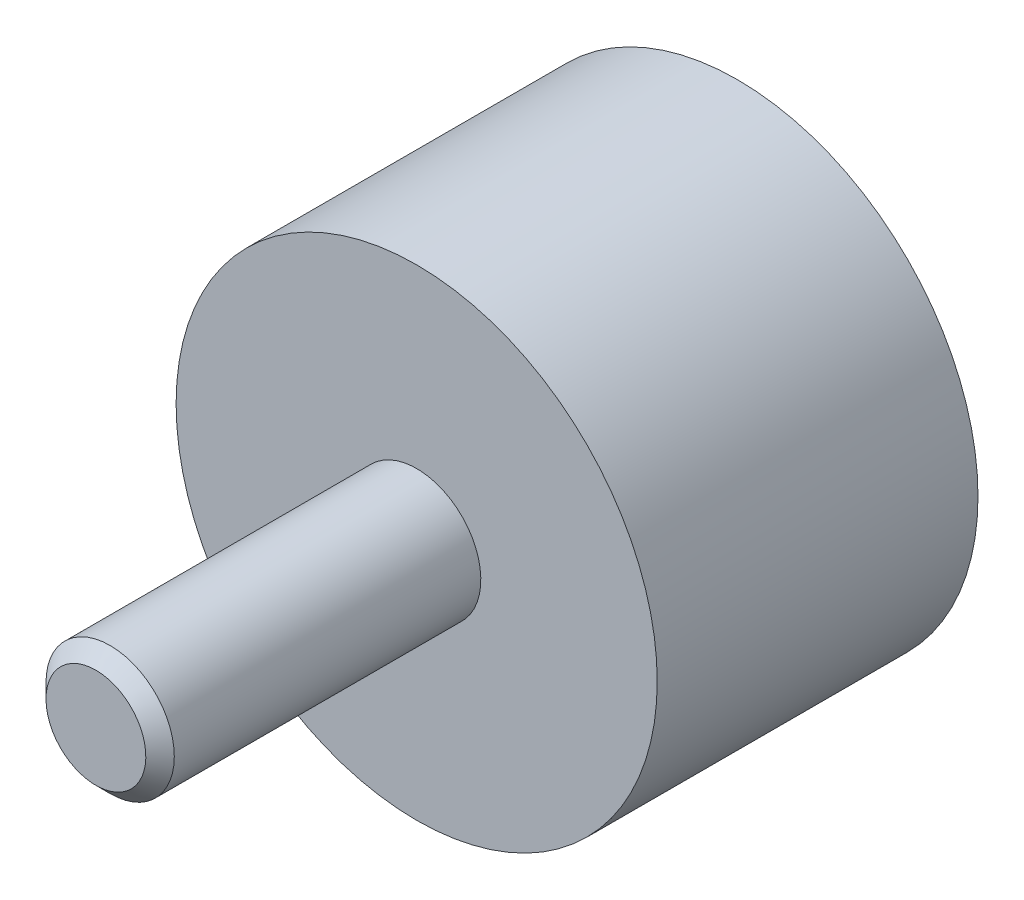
ISO-10303-21;
HEADER;
FILE_DESCRIPTION(('STEP AP214'),'2;1');
FILE_NAME('part.step','',(''),(''),'','','');
FILE_SCHEMA(('AUTOMOTIVE_DESIGN { 1 0 10303 214 1 1 1 1 }'));
ENDSEC;
DATA;
#1=APPLICATION_CONTEXT('core data for automotive mechanical design processes');
#2=APPLICATION_PROTOCOL_DEFINITION('international standard','automotive_design',2000,#1);
#3=PRODUCT_CONTEXT('',#1,'mechanical');
#4=PRODUCT('Part','Part','',(#3));
#5=PRODUCT_RELATED_PRODUCT_CATEGORY('part','',(#4));
#6=PRODUCT_DEFINITION_FORMATION('','',#4);
#7=PRODUCT_DEFINITION_CONTEXT('part definition',#1,'design');
#8=PRODUCT_DEFINITION('design','',#6,#7);
#9=PRODUCT_DEFINITION_SHAPE('','',#8);
#10=(LENGTH_UNIT() NAMED_UNIT(*) SI_UNIT(.MILLI.,.METRE.));
#11=(NAMED_UNIT(*) PLANE_ANGLE_UNIT() SI_UNIT($,.RADIAN.));
#12=(NAMED_UNIT(*) SI_UNIT($,.STERADIAN.) SOLID_ANGLE_UNIT());
#13=UNCERTAINTY_MEASURE_WITH_UNIT(LENGTH_MEASURE(1.E-05),#10,'distance_accuracy_value','');
#14=(GEOMETRIC_REPRESENTATION_CONTEXT(3) GLOBAL_UNCERTAINTY_ASSIGNED_CONTEXT((#13)) GLOBAL_UNIT_ASSIGNED_CONTEXT((#10,
#11,#12)) REPRESENTATION_CONTEXT('',''));
#15=CARTESIAN_POINT('',(0.,0.,0.));
#16=DIRECTION('',(0.,0.,1.));
#17=DIRECTION('',(1.,0.,0.));
#18=AXIS2_PLACEMENT_3D('',#15,#16,#17);
#19=CARTESIAN_POINT('',(0.,0.,0.));
#20=DIRECTION('',(0.,0.,1.));
#21=DIRECTION('',(0.,-1.,0.));
#22=AXIS2_PLACEMENT_3D('',#19,#20,#21);
#23=CYLINDRICAL_SURFACE('',#22,15.);
#24=CARTESIAN_POINT('',(0.,0.,0.));
#25=DIRECTION('',(0.,0.,1.));
#26=DIRECTION('',(0.,-1.,0.));
#27=AXIS2_PLACEMENT_3D('',#24,#25,#26);
#28=CIRCLE('',#27,15.);
#29=CARTESIAN_POINT('',(0.,-15.,0.));
#30=VERTEX_POINT('',#29);
#31=EDGE_CURVE('E18',#30,#30,#28,.T.);
#32=ORIENTED_EDGE('',*,*,#31,.T.);
#33=EDGE_LOOP('',(#32));
#34=FACE_BOUND('',#33,.T.);
#35=CARTESIAN_POINT('',(0.,0.,20.));
#36=DIRECTION('',(0.,0.,-1.));
#37=DIRECTION('',(0.,1.,0.));
#38=AXIS2_PLACEMENT_3D('',#35,#36,#37);
#39=CIRCLE('',#38,15.);
#40=CARTESIAN_POINT('',(0.,15.,20.));
#41=VERTEX_POINT('',#40);
#42=EDGE_CURVE('E22',#41,#41,#39,.T.);
#43=ORIENTED_EDGE('',*,*,#42,.T.);
#44=EDGE_LOOP('',(#43));
#45=FACE_BOUND('',#44,.T.);
#46=ADVANCED_FACE('F12',(#34,#45),#23,.T.);
#47=CARTESIAN_POINT('',(15.,0.,0.));
#48=DIRECTION('',(0.,0.,-1.));
#49=DIRECTION('',(0.,1.,0.));
#50=AXIS2_PLACEMENT_3D('',#47,#48,#49);
#51=PLANE('',#50);
#52=ORIENTED_EDGE('',*,*,#31,.F.);
#53=EDGE_LOOP('',(#52));
#54=FACE_BOUND('',#53,.T.);
#55=ADVANCED_FACE('F48',(#54),#51,.T.);
#56=CARTESIAN_POINT('',(15.,0.,20.));
#57=DIRECTION('',(0.,0.,1.));
#58=DIRECTION('',(0.,-1.,0.));
#59=AXIS2_PLACEMENT_3D('',#56,#57,#58);
#60=PLANE('',#59);
#61=CARTESIAN_POINT('',(0.,0.,20.));
#62=DIRECTION('',(0.,0.,1.));
#63=DIRECTION('',(0.,-1.,0.));
#64=AXIS2_PLACEMENT_3D('',#61,#62,#63);
#65=CIRCLE('',#64,4.);
#66=CARTESIAN_POINT('',(0.,-4.,20.));
#67=VERTEX_POINT('',#66);
#68=EDGE_CURVE('E8',#67,#67,#65,.F.);
#69=ORIENTED_EDGE('',*,*,#68,.T.);
#70=EDGE_LOOP('',(#69));
#71=FACE_BOUND('',#70,.T.);
#72=ORIENTED_EDGE('',*,*,#42,.F.);
#73=EDGE_LOOP('',(#72));
#74=FACE_BOUND('',#73,.T.);
#75=ADVANCED_FACE('F52',(#71,#74),#60,.T.);
#76=CARTESIAN_POINT('',(0.,0.,15.));
#77=DIRECTION('',(0.,0.,1.));
#78=DIRECTION('',(0.,-1.,0.));
#79=AXIS2_PLACEMENT_3D('',#76,#77,#78);
#80=CYLINDRICAL_SURFACE('',#79,4.);
#81=ORIENTED_EDGE('',*,*,#68,.F.);
#82=EDGE_LOOP('',(#81));
#83=FACE_BOUND('',#82,.T.);
#84=CARTESIAN_POINT('',(0.,0.,39.1119886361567));
#85=DIRECTION('',(0.,0.,-1.));
#86=DIRECTION('',(0.,1.,0.));
#87=AXIS2_PLACEMENT_3D('',#84,#85,#86);
#88=CIRCLE('',#87,4.);
#89=CARTESIAN_POINT('',(0.,4.,39.1119886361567));
#90=VERTEX_POINT('',#89);
#91=EDGE_CURVE('E26',#90,#90,#88,.T.);
#92=ORIENTED_EDGE('',*,*,#91,.T.);
#93=EDGE_LOOP('',(#92));
#94=FACE_BOUND('',#93,.T.);
#95=ADVANCED_FACE('F45',(#83,#94),#80,.T.);
#96=CARTESIAN_POINT('',(0.,0.,39.1119886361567));
#97=DIRECTION('',(0.,0.,-1.));
#98=DIRECTION('',(0.,1.,0.));
#99=AXIS2_PLACEMENT_3D('',#96,#97,#98);
#100=CONICAL_SURFACE('',#99,4.,0.785398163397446);
#101=CARTESIAN_POINT('',(0.,0.,40.));
#102=DIRECTION('',(0.,0.,-1.));
#103=DIRECTION('',(0.,1.,0.));
#104=AXIS2_PLACEMENT_3D('',#101,#102,#103);
#105=CIRCLE('',#104,3.11198863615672);
#106=CARTESIAN_POINT('',(0.,3.11198863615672,40.));
#107=VERTEX_POINT('',#106);
#108=EDGE_CURVE('E31',#107,#107,#105,.T.);
#109=ORIENTED_EDGE('',*,*,#108,.T.);
#110=EDGE_LOOP('',(#109));
#111=FACE_BOUND('',#110,.T.);
#112=ORIENTED_EDGE('',*,*,#91,.F.);
#113=EDGE_LOOP('',(#112));
#114=FACE_BOUND('',#113,.T.);
#115=ADVANCED_FACE('F35',(#111,#114),#100,.T.);
#116=CARTESIAN_POINT('',(3.11198863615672,0.,40.));
#117=DIRECTION('',(0.,0.,1.));
#118=DIRECTION('',(0.,-1.,0.));
#119=AXIS2_PLACEMENT_3D('',#116,#117,#118);
#120=PLANE('',#119);
#121=ORIENTED_EDGE('',*,*,#108,.F.);
#122=EDGE_LOOP('',(#121));
#123=FACE_BOUND('',#122,.T.);
#124=ADVANCED_FACE('F38',(#123),#120,.T.);
#125=CLOSED_SHELL('',(#46,#55,#75,#95,#115,#124));
#126=MANIFOLD_SOLID_BREP('B1',#125);
#127=ADVANCED_BREP_SHAPE_REPRESENTATION('',(#18,#126),#14);
#128=SHAPE_DEFINITION_REPRESENTATION(#9,#127);
ENDSEC;
END-ISO-10303-21;
